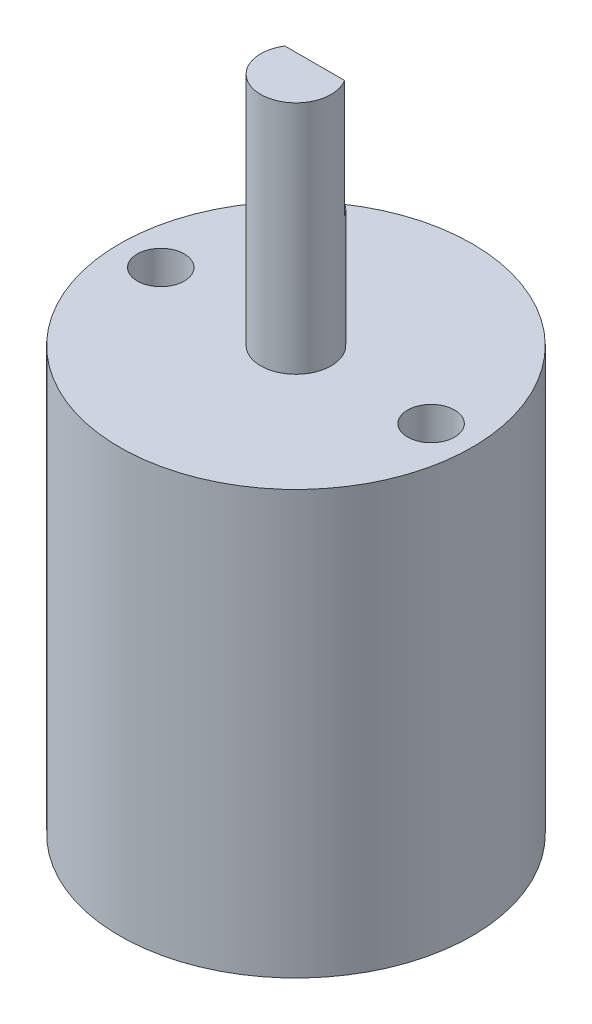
ISO-10303-21;
HEADER;
FILE_DESCRIPTION(('STEP AP214'),'2;1');
FILE_NAME('part.step','',(''),(''),'','','');
FILE_SCHEMA(('AUTOMOTIVE_DESIGN { 1 0 10303 214 1 1 1 1 }'));
ENDSEC;
DATA;
#1=APPLICATION_CONTEXT('core data for automotive mechanical design processes');
#2=APPLICATION_PROTOCOL_DEFINITION('international standard','automotive_design',2000,#1);
#3=PRODUCT_CONTEXT('',#1,'mechanical');
#4=PRODUCT('Part','Part','',(#3));
#5=PRODUCT_RELATED_PRODUCT_CATEGORY('part','',(#4));
#6=PRODUCT_DEFINITION_FORMATION('','',#4);
#7=PRODUCT_DEFINITION_CONTEXT('part definition',#1,'design');
#8=PRODUCT_DEFINITION('design','',#6,#7);
#9=PRODUCT_DEFINITION_SHAPE('','',#8);
#10=(LENGTH_UNIT() NAMED_UNIT(*) SI_UNIT(.MILLI.,.METRE.));
#11=(NAMED_UNIT(*) PLANE_ANGLE_UNIT() SI_UNIT($,.RADIAN.));
#12=(NAMED_UNIT(*) SI_UNIT($,.STERADIAN.) SOLID_ANGLE_UNIT());
#13=UNCERTAINTY_MEASURE_WITH_UNIT(LENGTH_MEASURE(1.E-05),#10,'distance_accuracy_value','');
#14=(GEOMETRIC_REPRESENTATION_CONTEXT(3) GLOBAL_UNCERTAINTY_ASSIGNED_CONTEXT((#13)) GLOBAL_UNIT_ASSIGNED_CONTEXT((#10,
#11,#12)) REPRESENTATION_CONTEXT('',''));
#15=CARTESIAN_POINT('',(0.,0.,0.));
#16=DIRECTION('',(0.,0.,1.));
#17=DIRECTION('',(1.,0.,0.));
#18=AXIS2_PLACEMENT_3D('',#15,#16,#17);
#19=CARTESIAN_POINT('',(7.5,0.,0.));
#20=DIRECTION('',(0.,-1.,0.));
#21=DIRECTION('',(0.,0.,-1.));
#22=AXIS2_PLACEMENT_3D('',#19,#20,#21);
#23=PLANE('',#22);
#24=CARTESIAN_POINT('',(0.,0.,0.));
#25=DIRECTION('',(0.,-1.,0.));
#26=DIRECTION('',(0.,0.,-1.));
#27=AXIS2_PLACEMENT_3D('',#24,#25,#26);
#28=CIRCLE('',#27,7.5);
#29=CARTESIAN_POINT('',(0.,0.,-7.5));
#30=VERTEX_POINT('',#29);
#31=EDGE_CURVE('E82',#30,#30,#28,.T.);
#32=ORIENTED_EDGE('',*,*,#31,.T.);
#33=EDGE_LOOP('',(#32));
#34=FACE_BOUND('',#33,.T.);
#35=ADVANCED_FACE('F36',(#34),#23,.T.);
#36=CARTESIAN_POINT('',(0.,28.,0.));
#37=DIRECTION('',(0.,1.,0.));
#38=DIRECTION('',(0.,0.,1.));
#39=AXIS2_PLACEMENT_3D('',#36,#37,#38);
#40=PLANE('',#39);
#41=DIRECTION('',(1.,0.,0.));
#42=VECTOR('',#41,1.);
#43=CARTESIAN_POINT('',(-2.51435321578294,28.,-0.8));
#44=LINE('',#43,#42);
#45=CARTESIAN_POINT('',(-1.26885775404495,28.,-0.8));
#46=VERTEX_POINT('',#45);
#47=CARTESIAN_POINT('',(1.26885775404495,28.,-0.8));
#48=VERTEX_POINT('',#47);
#49=EDGE_CURVE('E62',#46,#48,#44,.T.);
#50=ORIENTED_EDGE('',*,*,#49,.F.);
#51=CARTESIAN_POINT('',(0.,28.,0.));
#52=DIRECTION('',(0.,-1.,0.));
#53=DIRECTION('',(0.,0.,-1.));
#54=AXIS2_PLACEMENT_3D('',#51,#52,#53);
#55=CIRCLE('',#54,1.5);
#56=EDGE_CURVE('E69',#48,#46,#55,.T.);
#57=ORIENTED_EDGE('',*,*,#56,.F.);
#58=EDGE_LOOP('',(#50,#57));
#59=FACE_BOUND('',#58,.T.);
#60=ADVANCED_FACE('F68',(#59),#40,.T.);
#61=CARTESIAN_POINT('',(0.,0.,0.));
#62=DIRECTION('',(0.,-1.,0.));
#63=DIRECTION('',(0.,0.,-1.));
#64=AXIS2_PLACEMENT_3D('',#61,#62,#63);
#65=CYLINDRICAL_SURFACE('',#64,1.5);
#66=DIRECTION('',(0.,-1.,0.));
#67=VECTOR('',#66,1.);
#68=CARTESIAN_POINT('',(-1.26885775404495,0.,-0.8));
#69=LINE('',#68,#67);
#70=CARTESIAN_POINT('',(-1.26885775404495,23.,-0.8));
#71=VERTEX_POINT('',#70);
#72=EDGE_CURVE('E11',#71,#46,#69,.F.);
#73=ORIENTED_EDGE('',*,*,#72,.F.);
#74=CARTESIAN_POINT('',(0.,23.,0.));
#75=DIRECTION('',(0.,1.,0.));
#76=DIRECTION('',(0.,0.,1.));
#77=AXIS2_PLACEMENT_3D('',#74,#75,#76);
#78=CIRCLE('',#77,1.5);
#79=CARTESIAN_POINT('',(1.26885775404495,23.,-0.8));
#80=VERTEX_POINT('',#79);
#81=EDGE_CURVE('E53',#71,#80,#78,.F.);
#82=ORIENTED_EDGE('',*,*,#81,.T.);
#83=DIRECTION('',(0.,-1.,0.));
#84=VECTOR('',#83,1.);
#85=CARTESIAN_POINT('',(1.26885775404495,0.,-0.8));
#86=LINE('',#85,#84);
#87=EDGE_CURVE('E43',#48,#80,#86,.T.);
#88=ORIENTED_EDGE('',*,*,#87,.F.);
#89=ORIENTED_EDGE('',*,*,#56,.T.);
#90=EDGE_LOOP('',(#73,#82,#88,#89));
#91=FACE_BOUND('',#90,.T.);
#92=CARTESIAN_POINT('',(0.,18.,0.));
#93=DIRECTION('',(0.,-1.,0.));
#94=DIRECTION('',(0.,0.,-1.));
#95=AXIS2_PLACEMENT_3D('',#92,#93,#94);
#96=CIRCLE('',#95,1.5);
#97=CARTESIAN_POINT('',(0.,18.,-1.5));
#98=VERTEX_POINT('',#97);
#99=EDGE_CURVE('E73',#98,#98,#96,.T.);
#100=ORIENTED_EDGE('',*,*,#99,.F.);
#101=EDGE_LOOP('',(#100));
#102=FACE_BOUND('',#101,.T.);
#103=ADVANCED_FACE('F71',(#91,#102),#65,.T.);
#104=CARTESIAN_POINT('',(1.5,18.,0.));
#105=DIRECTION('',(0.,1.,0.));
#106=DIRECTION('',(0.,0.,1.));
#107=AXIS2_PLACEMENT_3D('',#104,#105,#106);
#108=PLANE('',#107);
#109=CARTESIAN_POINT('',(5.75,18.,0.));
#110=DIRECTION('',(0.,1.,0.));
#111=DIRECTION('',(0.,0.,-1.));
#112=AXIS2_PLACEMENT_3D('',#109,#110,#111);
#113=CIRCLE('',#112,1.);
#114=CARTESIAN_POINT('',(5.75,18.,-1.));
#115=VERTEX_POINT('',#114);
#116=EDGE_CURVE('E92',#115,#115,#113,.T.);
#117=ORIENTED_EDGE('',*,*,#116,.F.);
#118=EDGE_LOOP('',(#117));
#119=FACE_BOUND('',#118,.T.);
#120=CARTESIAN_POINT('',(-5.75,18.,0.));
#121=DIRECTION('',(0.,1.,0.));
#122=DIRECTION('',(0.,0.,1.));
#123=AXIS2_PLACEMENT_3D('',#120,#121,#122);
#124=CIRCLE('',#123,1.);
#125=CARTESIAN_POINT('',(-5.75,18.,1.));
#126=VERTEX_POINT('',#125);
#127=EDGE_CURVE('E86',#126,#126,#124,.T.);
#128=ORIENTED_EDGE('',*,*,#127,.F.);
#129=EDGE_LOOP('',(#128));
#130=FACE_BOUND('',#129,.T.);
#131=ORIENTED_EDGE('',*,*,#99,.T.);
#132=EDGE_LOOP('',(#131));
#133=FACE_BOUND('',#132,.T.);
#134=CARTESIAN_POINT('',(0.,18.,0.));
#135=DIRECTION('',(0.,-1.,0.));
#136=DIRECTION('',(0.,0.,-1.));
#137=AXIS2_PLACEMENT_3D('',#134,#135,#136);
#138=CIRCLE('',#137,7.5);
#139=CARTESIAN_POINT('',(0.,18.,-7.5));
#140=VERTEX_POINT('',#139);
#141=EDGE_CURVE('E77',#140,#140,#138,.T.);
#142=ORIENTED_EDGE('',*,*,#141,.F.);
#143=EDGE_LOOP('',(#142));
#144=FACE_BOUND('',#143,.T.);
#145=ADVANCED_FACE('F108',(#119,#130,#133,#144),#108,.T.);
#146=CARTESIAN_POINT('',(0.,0.,0.));
#147=DIRECTION('',(0.,-1.,0.));
#148=DIRECTION('',(0.,0.,-1.));
#149=AXIS2_PLACEMENT_3D('',#146,#147,#148);
#150=CYLINDRICAL_SURFACE('',#149,7.5);
#151=ORIENTED_EDGE('',*,*,#141,.T.);
#152=EDGE_LOOP('',(#151));
#153=FACE_BOUND('',#152,.T.);
#154=ORIENTED_EDGE('',*,*,#31,.F.);
#155=EDGE_LOOP('',(#154));
#156=FACE_BOUND('',#155,.T.);
#157=ADVANCED_FACE('F111',(#153,#156),#150,.T.);
#158=CARTESIAN_POINT('',(-5.75,13.,0.));
#159=DIRECTION('',(0.,1.,0.));
#160=DIRECTION('',(0.,0.,1.));
#161=AXIS2_PLACEMENT_3D('',#158,#159,#160);
#162=CYLINDRICAL_SURFACE('',#161,1.);
#163=CARTESIAN_POINT('',(-5.75,13.,0.));
#164=DIRECTION('',(0.,1.,0.));
#165=DIRECTION('',(0.,0.,1.));
#166=AXIS2_PLACEMENT_3D('',#163,#164,#165);
#167=CIRCLE('',#166,1.);
#168=CARTESIAN_POINT('',(-5.75,13.,1.));
#169=VERTEX_POINT('',#168);
#170=EDGE_CURVE('E85',#169,#169,#167,.T.);
#171=ORIENTED_EDGE('',*,*,#170,.F.);
#172=EDGE_LOOP('',(#171));
#173=FACE_BOUND('',#172,.T.);
#174=ORIENTED_EDGE('',*,*,#127,.T.);
#175=EDGE_LOOP('',(#174));
#176=FACE_BOUND('',#175,.T.);
#177=ADVANCED_FACE('F121',(#173,#176),#162,.F.);
#178=CARTESIAN_POINT('',(-5.75,13.,0.));
#179=DIRECTION('',(0.,1.,0.));
#180=DIRECTION('',(0.,0.,1.));
#181=AXIS2_PLACEMENT_3D('',#178,#179,#180);
#182=PLANE('',#181);
#183=ORIENTED_EDGE('',*,*,#170,.T.);
#184=EDGE_LOOP('',(#183));
#185=FACE_BOUND('',#184,.T.);
#186=ADVANCED_FACE('F104',(#185),#182,.T.);
#187=CARTESIAN_POINT('',(5.75,13.,0.));
#188=DIRECTION('',(0.,1.,0.));
#189=DIRECTION('',(0.,0.,1.));
#190=AXIS2_PLACEMENT_3D('',#187,#188,#189);
#191=CYLINDRICAL_SURFACE('',#190,1.);
#192=CARTESIAN_POINT('',(5.75,13.,0.));
#193=DIRECTION('',(0.,1.,0.));
#194=DIRECTION('',(0.,0.,-1.));
#195=AXIS2_PLACEMENT_3D('',#192,#193,#194);
#196=CIRCLE('',#195,1.);
#197=CARTESIAN_POINT('',(5.75,13.,-1.));
#198=VERTEX_POINT('',#197);
#199=EDGE_CURVE('E89',#198,#198,#196,.T.);
#200=ORIENTED_EDGE('',*,*,#199,.F.);
#201=EDGE_LOOP('',(#200));
#202=FACE_BOUND('',#201,.T.);
#203=ORIENTED_EDGE('',*,*,#116,.T.);
#204=EDGE_LOOP('',(#203));
#205=FACE_BOUND('',#204,.T.);
#206=ADVANCED_FACE('F101',(#202,#205),#191,.F.);
#207=CARTESIAN_POINT('',(5.75,13.,0.));
#208=DIRECTION('',(0.,-1.,0.));
#209=DIRECTION('',(0.,0.,-1.));
#210=AXIS2_PLACEMENT_3D('',#207,#208,#209);
#211=PLANE('',#210);
#212=ORIENTED_EDGE('',*,*,#199,.T.);
#213=EDGE_LOOP('',(#212));
#214=FACE_BOUND('',#213,.T.);
#215=ADVANCED_FACE('F99',(#214),#211,.F.);
#216=CARTESIAN_POINT('',(-2.51435321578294,23.,-0.8));
#217=DIRECTION('',(0.,0.,1.));
#218=DIRECTION('',(1.,0.,0.));
#219=AXIS2_PLACEMENT_3D('',#216,#217,#218);
#220=PLANE('',#219);
#221=ORIENTED_EDGE('',*,*,#72,.T.);
#222=ORIENTED_EDGE('',*,*,#49,.T.);
#223=ORIENTED_EDGE('',*,*,#87,.T.);
#224=DIRECTION('',(1.,0.,0.));
#225=VECTOR('',#224,1.);
#226=CARTESIAN_POINT('',(-2.51435321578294,23.,-0.8));
#227=LINE('',#226,#225);
#228=EDGE_CURVE('E49',#71,#80,#227,.T.);
#229=ORIENTED_EDGE('',*,*,#228,.F.);
#230=EDGE_LOOP('',(#221,#222,#223,#229));
#231=FACE_BOUND('',#230,.T.);
#232=ADVANCED_FACE('F61',(#231),#220,.F.);
#233=CARTESIAN_POINT('',(0.,23.,0.));
#234=DIRECTION('',(0.,1.,0.));
#235=DIRECTION('',(0.,0.,1.));
#236=AXIS2_PLACEMENT_3D('',#233,#234,#235);
#237=PLANE('',#236);
#238=ORIENTED_EDGE('',*,*,#228,.T.);
#239=ORIENTED_EDGE('',*,*,#81,.F.);
#240=EDGE_LOOP('',(#238,#239));
#241=FACE_BOUND('',#240,.T.);
#242=ADVANCED_FACE('F144',(#241),#237,.T.);
#243=CLOSED_SHELL('',(#35,#60,#103,#145,#157,#177,#186,#206,#215,#232,#242));
#244=MANIFOLD_SOLID_BREP('B2',#243);
#245=ADVANCED_BREP_SHAPE_REPRESENTATION('',(#18,#244),#14);
#246=SHAPE_DEFINITION_REPRESENTATION(#9,#245);
ENDSEC;
END-ISO-10303-21;
